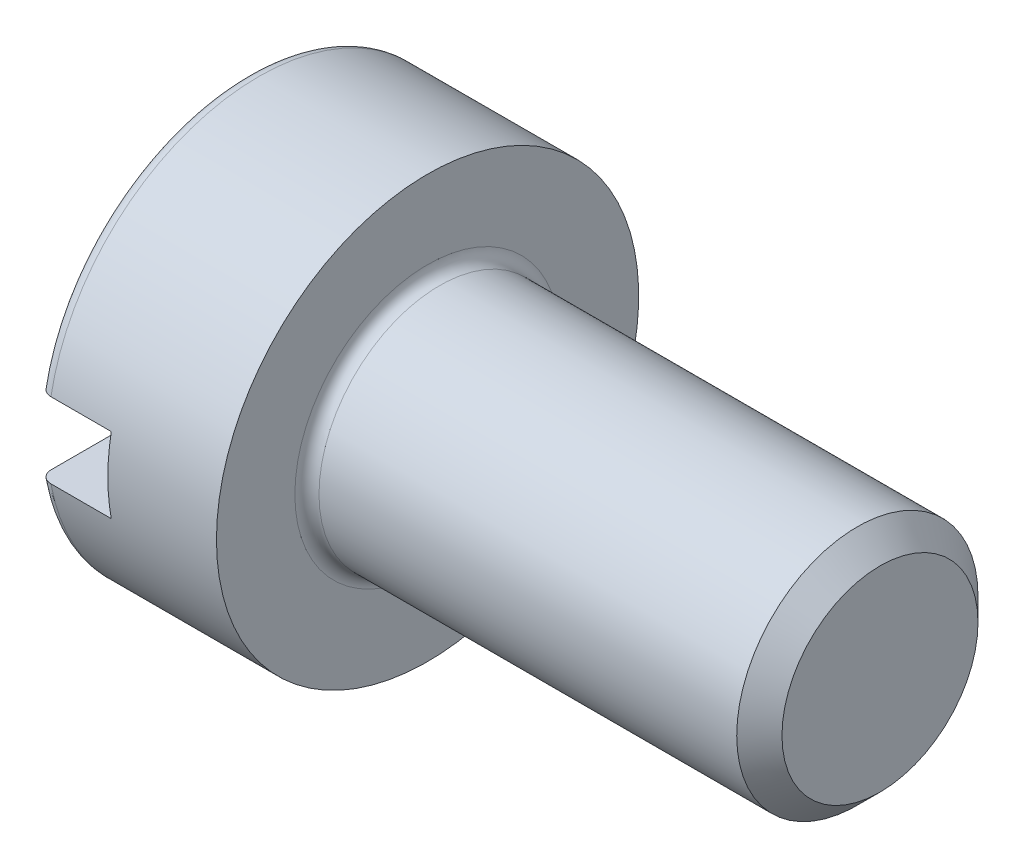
from build123d import *

# Parameters (mm, degrees)
FILLET1_R     = 0.4
FILLET2_R     = 0.4
SKETCH2_W     = 16
SKETCH2_H     = 2.5
SLOT_DEPTH    = 2.4
CHAMFER1_SIZE = 0.75


with BuildPart() as part:
    # BodySke → Base-Revolve (revolve)
    with BuildSketch(Plane.XY, mode=Mode.PRIVATE) as base_revolve_sk:
        Polygon((6, 4), (6, 7), (0, 7), (0, 0), (21, 0), (21, 4), align=None)
    revolve(base_revolve_sk.sketch.rotate(Axis((-25.4, 0, 0), (1, 0, 0)), 90), axis=Axis((-25.4, 0, 0), (1, 0, 0)))

    # Fillet1
    fillet1_edges = [part.edges().sort_by_distance(p)[0] for p in [
        (6, 0, -4),
    ]]
    fillet(fillet1_edges, radius=FILLET1_R)

    # Fillet2
    fillet2_edges = [part.edges().sort_by_distance(p)[0] for p in [
        (0, 0, -7),
    ]]
    fillet(fillet2_edges, radius=FILLET2_R)

    # Sketch2 → Slot (cut)
    with BuildSketch(Plane(origin=(0, 0, 0), x_dir=(0, 0, -1), z_dir=(1, 0, 0))):
        Rectangle(SKETCH2_W, SKETCH2_H)
    extrude(amount=SLOT_DEPTH, mode=Mode.SUBTRACT)

    # Chamfer1
    chamfer1_edges = [part.edges().sort_by_distance(p)[0] for p in [
        (21, 0, -4),
    ]]
    chamfer(chamfer1_edges, length=CHAMFER1_SIZE)


solid = part.part
